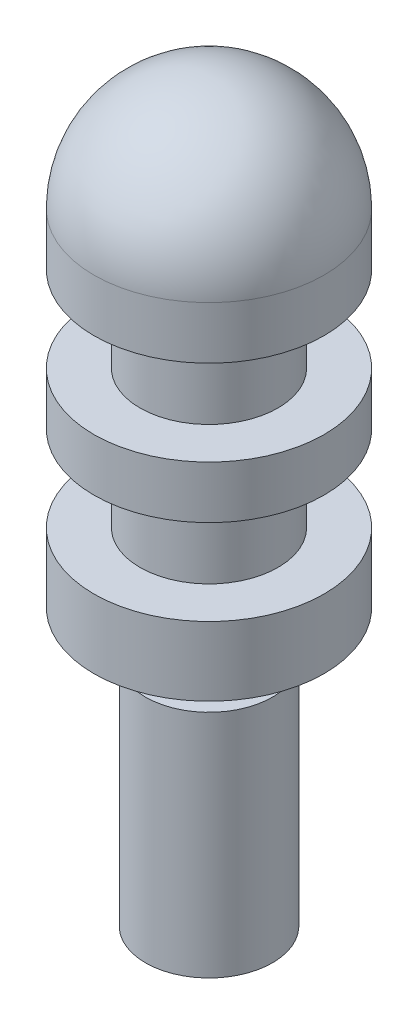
from build123d import *


with BuildPart() as part:
    # Sketch1 → Revolve1 (revolve)
    with BuildSketch(Plane.XY, mode=Mode.PRIVATE) as revolve1_sk:
        with BuildLine():
            Line((0, 5.316558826), (0, 20.32))
            ThreePointArc((0, 20.32), (-2.24506403, 19.39006403), (-3.175, 17.145))
            Line((-3.175, 17.145), (-3.175, 15.6972))
            Line((-3.175, 15.6972), (-1.905, 15.6972))
            Line((-1.905, 15.6972), (-1.905, 13.335))
            Line((-1.905, 13.335), (-3.175, 13.335))
            Line((-3.175, 13.335), (-3.175, 11.8872))
            Line((-3.175, 11.8872), (-1.905, 11.8872))
            Line((-1.905, 11.8872), (-1.905, 9.525))
            Line((-1.905, 9.525), (-3.175, 9.525))
            Line((-3.175, 9.525), (-3.175, 7.62))
            Line((-3.175, 7.62), (-1.26619, 7.62))
            Line((-1.26619, 7.62), (-1.26619, 6.35))
            Line((-1.26619, 6.35), (-1.7526, 6.35))
            Line((-1.7526, 6.35), (-1.7526, 0))
            Line((-1.7526, 0), (-0.3937, 0))
            Line((-0.3937, 0), (-0.3937, 5.08))
            Line((-0.3937, 5.08), (0, 5.316558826))
        make_face()
    revolve(revolve1_sk.sketch.rotate(Axis((0, 0, 0), (0, -1, 0)), 270), axis=Axis((0, 0, 0), (0, -1, 0)))


solid = part.part
